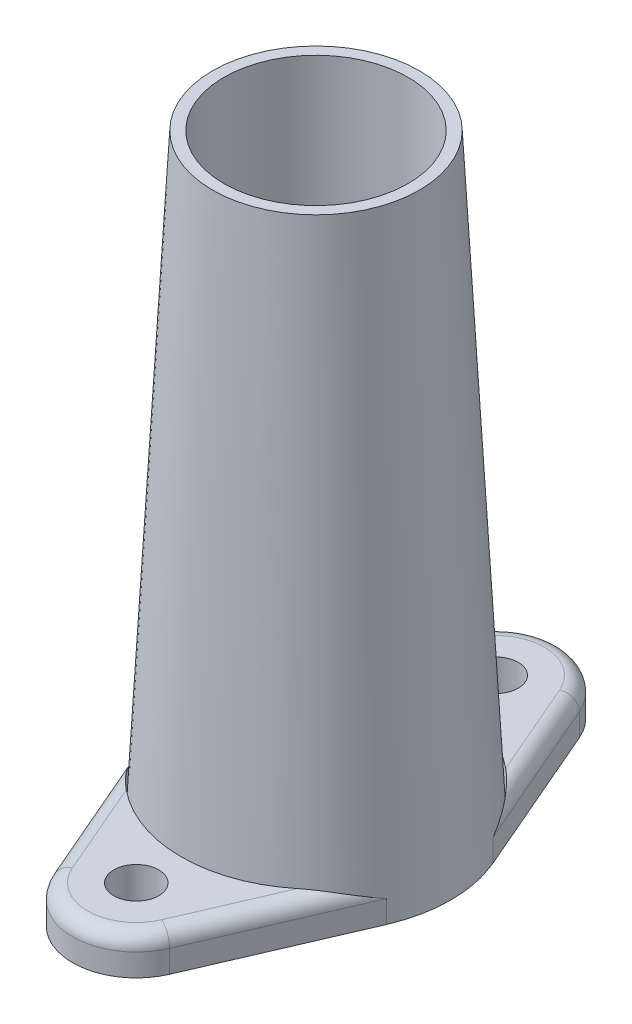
from build123d import *

# Parameters (mm, degrees)
ESQUISSE1_R             = 9
EXTRUSION1_DEPTH        = 40
EXTRUSION1_TAPER        = 3
ESQUISSE2_R             = 6.15
ENL_V_MAT_EXTRU_1_DEPTH = 37
ESQUISSE3_R             = 1.5
EXTRUSION2_DEPTH        = 2.5
EXTRUSION2_2_DEPTH      = 2.5
CONG_1_R                = 1
CONG_2_R                = 1
ESQUISSE4_R             = 5
ENL_V_MAT_EXTRU_2_DEPTH = 45.102539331


with BuildPart() as part:
    # Esquisse1 → Extrusion1 (new body)
    with BuildSketch(Plane(origin=(0, 0, 0), x_dir=(1, 0, 0), z_dir=(0, 1, 0))):
        Circle(ESQUISSE1_R)
    extrude(amount=EXTRUSION1_DEPTH, taper=EXTRUSION1_TAPER)

    # Esquisse2 → Enl_v. mat.-Extru.1 (cut)
    with BuildSketch(Plane(origin=(0, 40, 0), x_dir=(-1, 0, 0), z_dir=(0, 1, 0))):
        with Locations(Location((0, 0, 0), (0, 0, 90))):
            Circle(ESQUISSE2_R)
    extrude(amount=-ENL_V_MAT_EXTRU_1_DEPTH, mode=Mode.SUBTRACT)

    # Esquisse4 → Enl_v. mat.-Extru.2 (cut, through all)
    with BuildSketch(Plane.XZ):
        with Locations(Location((0, 0, 0), (0, 0, 270))):
            Circle(ESQUISSE4_R)
    extrude(amount=-ENL_V_MAT_EXTRU_2_DEPTH, mode=Mode.SUBTRACT)


with BuildPart() as body_2:
    # Esquisse3 → Extrusion2 (new body)
    with BuildSketch(Plane.XZ):
        with BuildLine():
            Line((8.264617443, -3.563158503), (3.901929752, -13.682255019))
            ThreePointArc((3.901929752, -13.682255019), (0, -16.249121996), (-3.901929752, -13.682255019))
            Line((-3.901929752, -13.682255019), (-8.264617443, -3.563158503))
            ThreePointArc((-8.264617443, -3.563158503), (0, -9), (8.264617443, -3.563158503))
        make_face()
        with Locations(Location((0, -12, 0), (0, 0, 270))):
            Circle(ESQUISSE3_R, mode=Mode.SUBTRACT)
    extrude(amount=-EXTRUSION2_DEPTH)

    # Cong_1
    cong_1_edges = [body_2.edges().sort_by_distance(p)[0] for p in [
        (0, 2.5, -16.249121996),
        (6.083273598, 2.5, -8.622706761),
        (-6.083273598, 2.5, -8.622706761),
    ]]
    fillet(cong_1_edges, radius=CONG_1_R)


with BuildPart() as body_3:
    # Esquisse3 → Extrusion2 2 (new body)
    with BuildSketch(Plane.XZ):
        with BuildLine():
            Line((-8.264617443, 3.563158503), (-3.901929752, 13.682255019))
            ThreePointArc((-3.901929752, 13.682255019), (0, 16.249121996), (3.901929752, 13.682255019))
            Line((3.901929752, 13.682255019), (8.264617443, 3.563158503))
            ThreePointArc((8.264617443, 3.563158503), (0, 9), (-8.264617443, 3.563158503))
        make_face()
        with Locations(Location((0, 12, 0), (0, 0, 90))):
            Circle(ESQUISSE3_R, mode=Mode.SUBTRACT)
    extrude(amount=-EXTRUSION2_2_DEPTH)

    # Cong_2
    cong_2_edges = [body_3.edges().sort_by_distance(p)[0] for p in [
        (6.083273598, 2.5, 8.622706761),
        (0, 2.5, 16.249121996),
        (-6.083273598, 2.5, 8.622706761),
    ]]
    fillet(cong_2_edges, radius=CONG_2_R)


solid = Compound([part.part, body_2.part, body_3.part])
